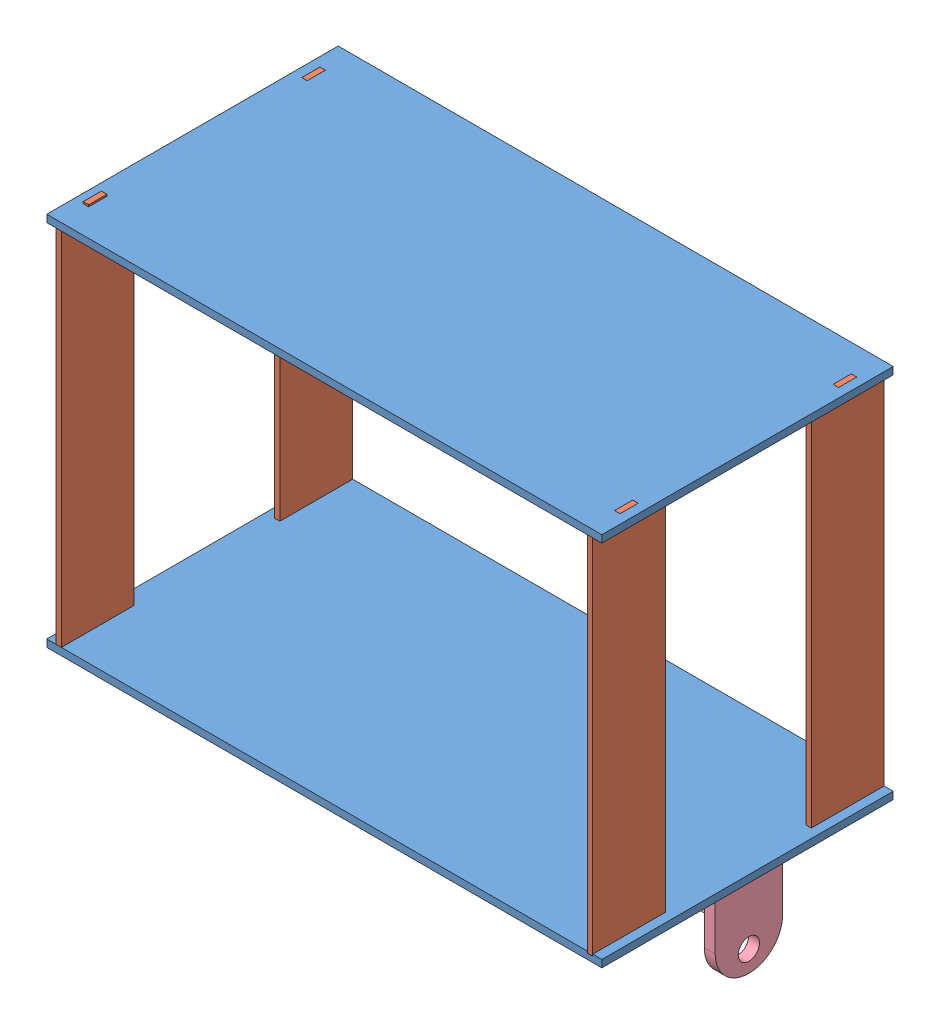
SolidWorks assembly Assem1.sldasm, configuration Default (file format 9000). Lengths in mm.
Overall size (304.8 250 160).
12 component instances, 4 part files, 19 mates.
Components (placement in the parent):
- bed-1: bed.SLDPRT [Default] at (43.0737 131.403 208.5844) x (1 0 0) z (0 1 0) size (304.8 160 4)
- stip-1: stip.SLDPRT [Default] at (-15.7664 144.6201 304.0187) x (0 0 -1) z (1 0 0) size (40 206 3)
- stip-2: stip.SLDPRT [Default] at (276.0336 143.6201 184.0187) x (0 0 -1) z (1 0 0) size (40 206 3)
- stip-3: stip.SLDPRT [Default] at (276.0336 143.6201 304.0187) x (0 0 -1) z (1 0 0) size (40 206 3)
- stip-4: stip.SLDPRT [Default] at (-15.7664 143.6201 184.0187) x (0 0 -1) z (1 0 0) size (40 206 3)
- bed-2: bed.SLDPRT [Default] at (43.0737 333.403 208.5844) x (1 0 0) z (0 1 0) size (304.8 160 4)
- bracket assembly-1: bracket assembly.SLDASM [Default] at (292.1972 142.6355 275.4836) x (0 0 -1) z (-1 0 0) size (37 43 54)
  - bracket part1-1: bracket part1.SLDPRT [Default] at (46.352 35.7325 14.1637) size (37 6 48)
  - bracketpart2-1: bracketpart2.SLDPRT [Default] at (46.352 35.7325 8.1637) size (37 43 6)
- bracket assembly-2: bracket assembly.SLDASM [Default] at (-28.9301 142.6355 237.807) x (0 0 1) z (1 0 0) size (37 43 54)
  - bracket part1-1: bracket part1.SLDPRT [Default] at (46.352 35.7325 14.1637) size (37 6 48)
  - bracketpart2-1: bracketpart2.SLDPRT [Default] at (46.352 35.7325 8.1637) size (37 43 6)
Mates (geometry in assembly coordinates):
- Coincident1: coincident anti-aligned: plane of bed-1 through (43.0737 135.403 208.5844) normal (0 1 0); plane of stip-1 through (-12.7664 135.403 337.4803) normal (0 -1 0)
- Coincident2: coincident anti-aligned: plane of bed-1 through (-12.7664 145.8433 322.4803) normal (-1 0 0); plane of stip-1 through (-12.7664 144.6201 304.0187) normal (1 0 0)
- Coincident3: coincident aligned: plane of bed-1 through (-20.7664 135.403 337.4803) normal (0 0 1); plane of stip-1 through (-12.7664 335.403 337.4803) normal (0 0 1)
- Coincident4: coincident anti-aligned: plane of bed-1 through (279.0336 145.8433 192.4803) normal (-1 0 0); plane of stip-2 through (279.0336 143.6201 184.0187) normal (1 0 0)
- Coincident5: coincident aligned: plane of bed-1 through (-20.7664 135.403 177.4803) normal (0 0 -1); plane of stip-2 through (279.0336 334.403 177.4803) normal (0 0 -1)
- Coincident6: coincident aligned: plane of bed-1 through (43.0737 131.403 208.5844) normal (0 -1 0); plane of stip-2 through (279.0336 131.403 202.4803) normal (0 -1 0)
- Coincident7: coincident anti-aligned: plane of bed-1 through (279.0336 145.8433 322.4803) normal (-1 0 0); plane of stip-3 through (279.0336 143.6201 304.0187) normal (1 0 0)
- Coincident8: coincident aligned: plane of bed-1 through (-20.7664 135.403 337.4803) normal (0 0 1); plane of stip-3 through (279.0336 334.403 337.4803) normal (0 0 1)
- Coincident9: coincident aligned: plane of bed-1 through (43.0737 131.403 208.5844) normal (0 -1 0); plane of stip-3 through (279.0336 131.403 322.4803) normal (0 -1 0)
- Coincident10: coincident anti-aligned: plane of bed-1 through (-15.7664 145.8433 192.4803) normal (1 0 0); plane of stip-4 through (-15.7664 143.6201 184.0187) normal (-1 0 0)
- Coincident11: coincident aligned: plane of bed-1 through (-20.7664 135.403 177.4803) normal (0 0 -1); plane of stip-4 through (-12.7664 334.403 177.4803) normal (0 0 -1)
- Coincident12: coincident aligned: plane of bed-1 through (43.0737 131.403 208.5844) normal (0 -1 0); plane of stip-4 through (-12.7664 131.403 202.4803) normal (0 -1 0)
- Coincident13: coincident aligned: plane of stip-2 through (279.0336 334.403 177.4803) normal (0 0 -1); plane of bed-2 through (-20.7664 337.403 177.4803) normal (0 0 -1)
- Coincident15: coincident aligned: plane of stip-2 through (279.0336 337.403 202.4803) normal (0 1 0); plane of bed-2 through (43.0737 337.403 208.5844) normal (0 1 0)
- Coincident16: coincident: plane of stip-2 through (276.0336 143.6201 184.0187) normal (-1 0 0); moEndPointRef_w of bed-2
- Coincident17: coincident aligned: plane of bed-1 through (284.0336 135.403 177.4803) normal (1 0 0); plane of bracket assembly-1/bracketpart2-1 through (284.0336 106.903 256.742) normal (1 0 0)
- Coincident18: coincident anti-aligned: plane of bed-1 through (43.0737 131.403 208.5844) normal (0 -1 0); plane of bracket assembly-1/bracketpart2-1 through (278.0336 131.403 238.242) normal (0 1 0)
- Coincident19: coincident aligned: plane of bed-1 through (-20.7664 135.403 187.4803) normal (-1 0 0); plane of bracket assembly-2/bracketpart2-1 through (-20.7664 106.903 256.5486) normal (-1 0 0)
- Coincident20: coincident anti-aligned: plane of bed-1 through (43.0737 131.403 208.5844) normal (0 -1 0); plane of bracket assembly-2/bracketpart2-1 through (-14.7664 131.403 275.0486) normal (0 1 0)
